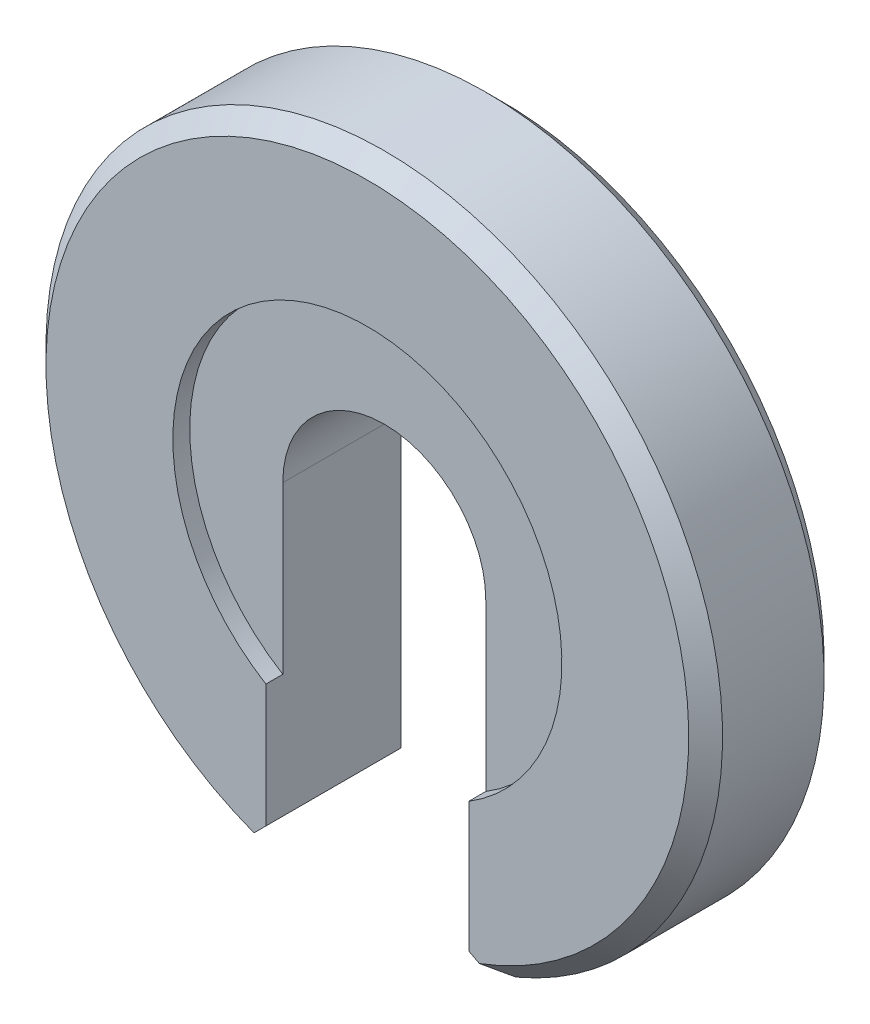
ISO-10303-21;
HEADER;
FILE_DESCRIPTION(('STEP AP214'),'2;1');
FILE_NAME('part.step','',(''),(''),'','','');
FILE_SCHEMA(('AUTOMOTIVE_DESIGN { 1 0 10303 214 1 1 1 1 }'));
ENDSEC;
DATA;
#1=APPLICATION_CONTEXT('core data for automotive mechanical design processes');
#2=APPLICATION_PROTOCOL_DEFINITION('international standard','automotive_design',2000,#1);
#3=PRODUCT_CONTEXT('',#1,'mechanical');
#4=PRODUCT('Part','Part','',(#3));
#5=PRODUCT_RELATED_PRODUCT_CATEGORY('part','',(#4));
#6=PRODUCT_DEFINITION_FORMATION('','',#4);
#7=PRODUCT_DEFINITION_CONTEXT('part definition',#1,'design');
#8=PRODUCT_DEFINITION('design','',#6,#7);
#9=PRODUCT_DEFINITION_SHAPE('','',#8);
#10=(LENGTH_UNIT() NAMED_UNIT(*) SI_UNIT(.MILLI.,.METRE.));
#11=(NAMED_UNIT(*) PLANE_ANGLE_UNIT() SI_UNIT($,.RADIAN.));
#12=(NAMED_UNIT(*) SI_UNIT($,.STERADIAN.) SOLID_ANGLE_UNIT());
#13=UNCERTAINTY_MEASURE_WITH_UNIT(LENGTH_MEASURE(1.E-05),#10,'distance_accuracy_value','');
#14=(GEOMETRIC_REPRESENTATION_CONTEXT(3) GLOBAL_UNCERTAINTY_ASSIGNED_CONTEXT((#13)) GLOBAL_UNIT_ASSIGNED_CONTEXT((#10,
#11,#12)) REPRESENTATION_CONTEXT('',''));
#15=CARTESIAN_POINT('',(0.,0.,0.));
#16=DIRECTION('',(0.,0.,1.));
#17=DIRECTION('',(1.,0.,0.));
#18=AXIS2_PLACEMENT_3D('',#15,#16,#17);
#19=CARTESIAN_POINT('',(0.,0.,-8.));
#20=DIRECTION('',(0.,0.,1.));
#21=DIRECTION('',(1.,0.,0.));
#22=AXIS2_PLACEMENT_3D('',#19,#20,#21);
#23=CYLINDRICAL_SURFACE('',#22,6.);
#24=CARTESIAN_POINT('',(0.,0.,-1.00000000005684));
#25=DIRECTION('',(0.,0.,1.));
#26=DIRECTION('',(1.,0.,0.));
#27=AXIS2_PLACEMENT_3D('',#24,#25,#26);
#28=CIRCLE('',#27,6.);
#29=CARTESIAN_POINT('',(-6.,0.,-1.00000000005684));
#30=VERTEX_POINT('',#29);
#31=CARTESIAN_POINT('',(6.,0.,-1.00000000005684));
#32=VERTEX_POINT('',#31);
#33=EDGE_CURVE('E55',#30,#32,#28,.F.);
#34=ORIENTED_EDGE('',*,*,#33,.F.);
#35=DIRECTION('',(0.,0.,1.));
#36=VECTOR('',#35,1.);
#37=CARTESIAN_POINT('',(-6.,0.,-8.));
#38=LINE('',#37,#36);
#39=CARTESIAN_POINT('',(-6.,0.,-8.));
#40=VERTEX_POINT('',#39);
#41=EDGE_CURVE('E148',#40,#30,#38,.T.);
#42=ORIENTED_EDGE('',*,*,#41,.F.);
#43=CARTESIAN_POINT('',(0.,0.,-8.));
#44=DIRECTION('',(0.,0.,1.));
#45=DIRECTION('',(-1.,0.,0.));
#46=AXIS2_PLACEMENT_3D('',#43,#44,#45);
#47=CIRCLE('',#46,6.);
#48=CARTESIAN_POINT('',(6.,0.,-8.));
#49=VERTEX_POINT('',#48);
#50=EDGE_CURVE('E143',#49,#40,#47,.T.);
#51=ORIENTED_EDGE('',*,*,#50,.F.);
#52=DIRECTION('',(0.,0.,1.));
#53=VECTOR('',#52,1.);
#54=CARTESIAN_POINT('',(6.,0.,-8.));
#55=LINE('',#54,#53);
#56=EDGE_CURVE('E151',#49,#32,#55,.T.);
#57=ORIENTED_EDGE('',*,*,#56,.T.);
#58=EDGE_LOOP('',(#34,#42,#51,#57));
#59=FACE_BOUND('',#58,.T.);
#60=ADVANCED_FACE('F39',(#59),#23,.F.);
#61=CARTESIAN_POINT('',(0.,0.,-8.));
#62=DIRECTION('',(0.,0.,1.));
#63=DIRECTION('',(1.,0.,0.));
#64=AXIS2_PLACEMENT_3D('',#61,#62,#63);
#65=CYLINDRICAL_SURFACE('',#64,20.);
#66=CARTESIAN_POINT('',(0.,0.,-1.00000000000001));
#67=DIRECTION('',(0.,0.,1.));
#68=DIRECTION('',(1.,0.,0.));
#69=AXIS2_PLACEMENT_3D('',#66,#67,#68);
#70=CIRCLE('',#69,20.);
#71=CARTESIAN_POINT('',(-7.47272296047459,-18.5515069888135,-1.00000000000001));
#72=VERTEX_POINT('',#71);
#73=CARTESIAN_POINT('',(7.79340894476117,-18.4190873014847,-1.00000000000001));
#74=VERTEX_POINT('',#73);
#75=EDGE_CURVE('E159',#72,#74,#70,.F.);
#76=ORIENTED_EDGE('',*,*,#75,.T.);
#77=DIRECTION('',(0.,0.,1.));
#78=VECTOR('',#77,1.);
#79=CARTESIAN_POINT('',(7.79340894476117,-18.4190873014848,-8.));
#80=LINE('',#79,#78);
#81=CARTESIAN_POINT('',(7.79340894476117,-18.4190873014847,-6.99999999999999));
#82=VERTEX_POINT('',#81);
#83=EDGE_CURVE('E214',#74,#82,#80,.F.);
#84=ORIENTED_EDGE('',*,*,#83,.T.);
#85=CARTESIAN_POINT('',(0.,0.,-6.99999999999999));
#86=DIRECTION('',(0.,0.,1.));
#87=DIRECTION('',(1.,0.,0.));
#88=AXIS2_PLACEMENT_3D('',#85,#86,#87);
#89=CIRCLE('',#88,20.);
#90=CARTESIAN_POINT('',(-7.47272296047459,-18.5515069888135,-6.99999999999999));
#91=VERTEX_POINT('',#90);
#92=EDGE_CURVE('E156',#82,#91,#89,.T.);
#93=ORIENTED_EDGE('',*,*,#92,.T.);
#94=DIRECTION('',(0.,0.,1.));
#95=VECTOR('',#94,1.);
#96=CARTESIAN_POINT('',(-7.47272296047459,-18.5515069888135,-8.));
#97=LINE('',#96,#95);
#98=EDGE_CURVE('E215',#91,#72,#97,.T.);
#99=ORIENTED_EDGE('',*,*,#98,.T.);
#100=EDGE_LOOP('',(#76,#84,#93,#99));
#101=FACE_BOUND('',#100,.T.);
#102=ADVANCED_FACE('F191',(#101),#65,.T.);
#103=CARTESIAN_POINT('',(0.,0.,-8.));
#104=DIRECTION('',(0.,0.,1.));
#105=DIRECTION('',(1.,0.,0.));
#106=AXIS2_PLACEMENT_3D('',#103,#104,#105);
#107=PLANE('',#106);
#108=CARTESIAN_POINT('',(0.,0.,-8.));
#109=DIRECTION('',(0.,0.,1.));
#110=DIRECTION('',(1.,0.,0.));
#111=AXIS2_PLACEMENT_3D('',#108,#109,#110);
#112=CIRCLE('',#111,19.);
#113=CARTESIAN_POINT('',(-6.7005073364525,-17.7792913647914,-8.));
#114=VERTEX_POINT('',#113);
#115=CARTESIAN_POINT('',(6.62255143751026,-17.8084758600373,-8.));
#116=VERTEX_POINT('',#115);
#117=EDGE_CURVE('E162',#114,#116,#112,.F.);
#118=ORIENTED_EDGE('',*,*,#117,.T.);
#119=DIRECTION('',(0.886668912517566,-0.462404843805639,0.));
#120=VECTOR('',#119,1.);
#121=CARTESIAN_POINT('',(6.,-17.4838103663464,-8.));
#122=LINE('',#121,#120);
#123=CARTESIAN_POINT('',(6.,-17.4838103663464,-8.));
#124=VERTEX_POINT('',#123);
#125=EDGE_CURVE('E228',#116,#124,#122,.F.);
#126=ORIENTED_EDGE('',*,*,#125,.T.);
#127=DIRECTION('',(0.,1.,0.));
#128=VECTOR('',#127,1.);
#129=CARTESIAN_POINT('',(6.,0.,-8.));
#130=LINE('',#129,#128);
#131=EDGE_CURVE('E141',#124,#49,#130,.T.);
#132=ORIENTED_EDGE('',*,*,#131,.T.);
#133=ORIENTED_EDGE('',*,*,#50,.T.);
#134=DIRECTION('',(0.,-1.,0.));
#135=VECTOR('',#134,1.);
#136=CARTESIAN_POINT('',(-6.,-19.0787840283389,-8.));
#137=LINE('',#136,#135);
#138=CARTESIAN_POINT('',(-6.,-17.0787840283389,-8.));
#139=VERTEX_POINT('',#138);
#140=EDGE_CURVE('E154',#40,#139,#137,.T.);
#141=ORIENTED_EDGE('',*,*,#140,.T.);
#142=DIRECTION('',(0.707106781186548,0.707106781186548,0.));
#143=VECTOR('',#142,1.);
#144=CARTESIAN_POINT('',(-7.47272296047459,-18.5515069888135,-8.));
#145=LINE('',#144,#143);
#146=EDGE_CURVE('E230',#139,#114,#145,.F.);
#147=ORIENTED_EDGE('',*,*,#146,.T.);
#148=EDGE_LOOP('',(#118,#126,#132,#133,#141,#147));
#149=FACE_BOUND('',#148,.T.);
#150=ADVANCED_FACE('F243',(#149),#107,.F.);
#151=CARTESIAN_POINT('',(0.,0.,0.));
#152=DIRECTION('',(0.,0.,1.));
#153=DIRECTION('',(1.,0.,0.));
#154=AXIS2_PLACEMENT_3D('',#151,#152,#153);
#155=PLANE('',#154);
#156=CARTESIAN_POINT('',(0.,0.,-5.6843418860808E-11));
#157=DIRECTION('',(0.,0.,1.));
#158=DIRECTION('',(1.,0.,0.));
#159=AXIS2_PLACEMENT_3D('',#156,#157,#158);
#160=CIRCLE('',#159,11.5);
#161=CARTESIAN_POINT('',(6.,-9.81070843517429,-5.6843418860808E-11));
#162=VERTEX_POINT('',#161);
#163=CARTESIAN_POINT('',(-6.,-9.81070843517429,-5.6843418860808E-11));
#164=VERTEX_POINT('',#163);
#165=EDGE_CURVE('E117',#162,#164,#160,.T.);
#166=ORIENTED_EDGE('',*,*,#165,.F.);
#167=DIRECTION('',(0.,1.,0.));
#168=VECTOR('',#167,1.);
#169=CARTESIAN_POINT('',(6.,0.,0.));
#170=LINE('',#169,#168);
#171=CARTESIAN_POINT('',(6.,-17.4838103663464,0.));
#172=VERTEX_POINT('',#171);
#173=EDGE_CURVE('E135',#172,#162,#170,.T.);
#174=ORIENTED_EDGE('',*,*,#173,.F.);
#175=DIRECTION('',(-0.886668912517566,0.462404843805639,0.));
#176=VECTOR('',#175,1.);
#177=CARTESIAN_POINT('',(-5.88545281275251,-11.2854528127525,0.));
#178=LINE('',#177,#176);
#179=CARTESIAN_POINT('',(6.62255143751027,-17.8084758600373,0.));
#180=VERTEX_POINT('',#179);
#181=EDGE_CURVE('E169',#172,#180,#178,.F.);
#182=ORIENTED_EDGE('',*,*,#181,.T.);
#183=CARTESIAN_POINT('',(0.,0.,0.));
#184=DIRECTION('',(0.,0.,1.));
#185=DIRECTION('',(1.,0.,0.));
#186=AXIS2_PLACEMENT_3D('',#183,#184,#185);
#187=CIRCLE('',#186,19.);
#188=CARTESIAN_POINT('',(-6.7005073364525,-17.7792913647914,0.));
#189=VERTEX_POINT('',#188);
#190=EDGE_CURVE('E150',#180,#189,#187,.T.);
#191=ORIENTED_EDGE('',*,*,#190,.T.);
#192=DIRECTION('',(-0.707106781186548,-0.707106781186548,0.));
#193=VECTOR('',#192,1.);
#194=CARTESIAN_POINT('',(5.53939201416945,-5.53939201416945,0.));
#195=LINE('',#194,#193);
#196=CARTESIAN_POINT('',(-6.,-17.0787840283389,0.));
#197=VERTEX_POINT('',#196);
#198=EDGE_CURVE('E140',#189,#197,#195,.F.);
#199=ORIENTED_EDGE('',*,*,#198,.T.);
#200=DIRECTION('',(0.,-1.,0.));
#201=VECTOR('',#200,1.);
#202=CARTESIAN_POINT('',(-6.,-19.0787840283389,0.));
#203=LINE('',#202,#201);
#204=EDGE_CURVE('E131',#164,#197,#203,.T.);
#205=ORIENTED_EDGE('',*,*,#204,.F.);
#206=EDGE_LOOP('',(#166,#174,#182,#191,#199,#205));
#207=FACE_BOUND('',#206,.T.);
#208=ADVANCED_FACE('F137',(#207),#155,.T.);
#209=CARTESIAN_POINT('',(0.,0.,0.));
#210=DIRECTION('',(0.,0.,-1.));
#211=DIRECTION('',(-1.,0.,0.));
#212=AXIS2_PLACEMENT_3D('',#209,#210,#211);
#213=CONICAL_SURFACE('',#212,19.,0.785398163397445);
#214=ORIENTED_EDGE('',*,*,#190,.F.);
#215=CARTESIAN_POINT('',(6.62255143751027,-17.8084758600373,0.));
#216=CARTESIAN_POINT('',(6.72082188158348,-17.8597246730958,-0.0822880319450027));
#217=CARTESIAN_POINT('',(6.81890789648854,-17.9108773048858,-0.164855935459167));
#218=CARTESIAN_POINT('',(7.01472407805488,-18.0129969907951,-0.330521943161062));
#219=CARTESIAN_POINT('',(7.11245425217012,-18.0639640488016,-0.413620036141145));
#220=CARTESIAN_POINT('',(7.30757574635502,-18.1657214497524,-0.580320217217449));
#221=CARTESIAN_POINT('',(7.40496706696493,-18.2165117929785,-0.66392230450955));
#222=CARTESIAN_POINT('',(7.59942703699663,-18.3179242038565,-0.831607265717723));
#223=CARTESIAN_POINT('',(7.69649567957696,-18.3685462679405,-0.915690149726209));
#224=CARTESIAN_POINT('',(7.79340894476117,-18.4190873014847,-1.00000000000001));
#225=B_SPLINE_CURVE_WITH_KNOTS('',3,(#215,#216,#217,#218,#219,#220,#221,#222,#223,#224),
.UNSPECIFIED.,.F.,.F.,(4,2,2,2,4),(0.,0.414117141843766,0.828225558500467,1.24233331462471,
1.65644979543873),.UNSPECIFIED.);
#226=EDGE_CURVE('E178',#180,#74,#225,.T.);
#227=ORIENTED_EDGE('',*,*,#226,.T.);
#228=ORIENTED_EDGE('',*,*,#75,.F.);
#229=CARTESIAN_POINT('',(-7.47272296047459,-18.5515069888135,-1.00000000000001));
#230=CARTESIAN_POINT('',(-7.34431028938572,-18.4230943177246,-0.832885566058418));
#231=CARTESIAN_POINT('',(-7.2157526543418,-18.2945366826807,-0.665995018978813));
#232=CARTESIAN_POINT('',(-6.95834744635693,-18.0371314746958,-0.332661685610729));
#233=CARTESIAN_POINT('',(-6.82949987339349,-17.9082839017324,-0.166218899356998));
#234=CARTESIAN_POINT('',(-6.7005073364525,-17.7792913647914,0.));
#235=B_SPLINE_CURVE_WITH_KNOTS('',3,(#229,#230,#231,#232,#233,#234),.UNSPECIFIED.,.F.,.F.,(4,2,
4),(0.,0.740377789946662,1.48075563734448),.UNSPECIFIED.);
#236=EDGE_CURVE('E171',#72,#189,#235,.T.);
#237=ORIENTED_EDGE('',*,*,#236,.T.);
#238=EDGE_LOOP('',(#214,#227,#228,#237));
#239=FACE_BOUND('',#238,.T.);
#240=ADVANCED_FACE('F184',(#239),#213,.T.);
#241=CARTESIAN_POINT('',(0.,0.,-6.99999999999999));
#242=DIRECTION('',(0.,0.,1.));
#243=DIRECTION('',(1.,0.,0.));
#244=AXIS2_PLACEMENT_3D('',#241,#242,#243);
#245=CONICAL_SURFACE('',#244,20.,0.78539816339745);
#246=ORIENTED_EDGE('',*,*,#92,.F.);
#247=CARTESIAN_POINT('',(7.79340894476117,-18.4190873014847,-6.99999999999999));
#248=CARTESIAN_POINT('',(7.69649567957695,-18.3685462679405,-7.08430985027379));
#249=CARTESIAN_POINT('',(7.59942703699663,-18.3179242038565,-7.16839273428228));
#250=CARTESIAN_POINT('',(7.40496706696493,-18.2165117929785,-7.33607769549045));
#251=CARTESIAN_POINT('',(7.30757574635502,-18.1657214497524,-7.41967978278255));
#252=CARTESIAN_POINT('',(7.11245425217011,-18.0639640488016,-7.58637996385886));
#253=CARTESIAN_POINT('',(7.01472407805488,-18.0129969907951,-7.66947805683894));
#254=CARTESIAN_POINT('',(6.81890789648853,-17.9108773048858,-7.83514406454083));
#255=CARTESIAN_POINT('',(6.72082188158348,-17.8597246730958,-7.917711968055));
#256=CARTESIAN_POINT('',(6.62255143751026,-17.8084758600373,-8.));
#257=B_SPLINE_CURVE_WITH_KNOTS('',3,(#247,#248,#249,#250,#251,#252,#253,#254,#255,#256),
.UNSPECIFIED.,.F.,.F.,(4,2,2,2,4),(0.,0.414116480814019,0.828224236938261,1.24233265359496,
1.65644979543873),.UNSPECIFIED.);
#258=EDGE_CURVE('E201',#82,#116,#257,.T.);
#259=ORIENTED_EDGE('',*,*,#258,.T.);
#260=ORIENTED_EDGE('',*,*,#117,.F.);
#261=CARTESIAN_POINT('',(-6.7005073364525,-17.7792913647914,-8.));
#262=CARTESIAN_POINT('',(-6.82949987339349,-17.9082839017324,-7.833781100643));
#263=CARTESIAN_POINT('',(-6.95834744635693,-18.0371314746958,-7.66733831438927));
#264=CARTESIAN_POINT('',(-7.2157526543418,-18.2945366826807,-7.33400498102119));
#265=CARTESIAN_POINT('',(-7.34431028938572,-18.4230943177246,-7.16711443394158));
#266=CARTESIAN_POINT('',(-7.47272296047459,-18.5515069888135,-6.99999999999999));
#267=B_SPLINE_CURVE_WITH_KNOTS('',3,(#261,#262,#263,#264,#265,#266),.UNSPECIFIED.,.F.,.F.,(4,2,
4),(0.,0.740377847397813,1.48075563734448),.UNSPECIFIED.);
#268=EDGE_CURVE('E208',#114,#91,#267,.T.);
#269=ORIENTED_EDGE('',*,*,#268,.T.);
#270=EDGE_LOOP('',(#246,#259,#260,#269));
#271=FACE_BOUND('',#270,.T.);
#272=ADVANCED_FACE('F189',(#271),#245,.T.);
#273=CARTESIAN_POINT('',(-6.,-19.0787840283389,-8.));
#274=DIRECTION('',(-1.,0.,0.));
#275=DIRECTION('',(0.,0.,1.));
#276=AXIS2_PLACEMENT_3D('',#273,#274,#275);
#277=PLANE('',#276);
#278=DIRECTION('',(0.,1.,0.));
#279=VECTOR('',#278,1.);
#280=CARTESIAN_POINT('',(-6.,-19.0787840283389,-1.00000000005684));
#281=LINE('',#280,#279);
#282=CARTESIAN_POINT('',(-6.,-9.81070843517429,-1.00000000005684));
#283=VERTEX_POINT('',#282);
#284=EDGE_CURVE('E134',#283,#30,#281,.T.);
#285=ORIENTED_EDGE('',*,*,#284,.F.);
#286=DIRECTION('',(0.,0.,1.));
#287=VECTOR('',#286,1.);
#288=CARTESIAN_POINT('',(-6.,-9.81070843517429,-1.00000000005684));
#289=LINE('',#288,#287);
#290=EDGE_CURVE('E121',#283,#164,#289,.T.);
#291=ORIENTED_EDGE('',*,*,#290,.T.);
#292=ORIENTED_EDGE('',*,*,#204,.T.);
#293=DIRECTION('',(0.,0.,-1.));
#294=VECTOR('',#293,1.);
#295=CARTESIAN_POINT('',(-6.,-17.0787840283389,-6.99999999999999));
#296=LINE('',#295,#294);
#297=EDGE_CURVE('E63',#197,#139,#296,.T.);
#298=ORIENTED_EDGE('',*,*,#297,.T.);
#299=ORIENTED_EDGE('',*,*,#140,.F.);
#300=ORIENTED_EDGE('',*,*,#41,.T.);
#301=EDGE_LOOP('',(#285,#291,#292,#298,#299,#300));
#302=FACE_BOUND('',#301,.T.);
#303=ADVANCED_FACE('F130',(#302),#277,.F.);
#304=CARTESIAN_POINT('',(6.,0.,-8.));
#305=DIRECTION('',(1.,0.,0.));
#306=DIRECTION('',(0.,1.,0.));
#307=AXIS2_PLACEMENT_3D('',#304,#305,#306);
#308=PLANE('',#307);
#309=ORIENTED_EDGE('',*,*,#173,.T.);
#310=DIRECTION('',(0.,0.,1.));
#311=VECTOR('',#310,1.);
#312=CARTESIAN_POINT('',(6.,-9.81070843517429,-1.00000000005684));
#313=LINE('',#312,#311);
#314=CARTESIAN_POINT('',(6.,-9.81070843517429,-1.00000000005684));
#315=VERTEX_POINT('',#314);
#316=EDGE_CURVE('E11',#162,#315,#313,.F.);
#317=ORIENTED_EDGE('',*,*,#316,.T.);
#318=DIRECTION('',(0.,-1.,0.));
#319=VECTOR('',#318,1.);
#320=CARTESIAN_POINT('',(6.,0.,-1.00000000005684));
#321=LINE('',#320,#319);
#322=EDGE_CURVE('E48',#32,#315,#321,.T.);
#323=ORIENTED_EDGE('',*,*,#322,.F.);
#324=ORIENTED_EDGE('',*,*,#56,.F.);
#325=ORIENTED_EDGE('',*,*,#131,.F.);
#326=DIRECTION('',(0.,0.,1.));
#327=VECTOR('',#326,1.);
#328=CARTESIAN_POINT('',(6.,-17.4838103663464,-1.00000000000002));
#329=LINE('',#328,#327);
#330=EDGE_CURVE('E165',#124,#172,#329,.T.);
#331=ORIENTED_EDGE('',*,*,#330,.T.);
#332=EDGE_LOOP('',(#309,#317,#323,#324,#325,#331));
#333=FACE_BOUND('',#332,.T.);
#334=ADVANCED_FACE('F239',(#333),#308,.F.);
#335=CARTESIAN_POINT('',(6.,-17.4838103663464,-8.));
#336=DIRECTION('',(0.462404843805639,0.886668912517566,0.));
#337=DIRECTION('',(-0.886668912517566,0.462404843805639,0.));
#338=AXIS2_PLACEMENT_3D('',#335,#336,#337);
#339=PLANE('',#338);
#340=ORIENTED_EDGE('',*,*,#258,.F.);
#341=ORIENTED_EDGE('',*,*,#83,.F.);
#342=ORIENTED_EDGE('',*,*,#226,.F.);
#343=ORIENTED_EDGE('',*,*,#181,.F.);
#344=ORIENTED_EDGE('',*,*,#330,.F.);
#345=ORIENTED_EDGE('',*,*,#125,.F.);
#346=EDGE_LOOP('',(#340,#341,#342,#343,#344,#345));
#347=FACE_BOUND('',#346,.T.);
#348=ADVANCED_FACE('F197',(#347),#339,.F.);
#349=CARTESIAN_POINT('',(-7.47272296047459,-18.5515069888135,-8.));
#350=DIRECTION('',(-0.707106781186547,0.707106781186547,0.));
#351=DIRECTION('',(-0.707106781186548,-0.707106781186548,0.));
#352=AXIS2_PLACEMENT_3D('',#349,#350,#351);
#353=PLANE('',#352);
#354=ORIENTED_EDGE('',*,*,#146,.F.);
#355=ORIENTED_EDGE('',*,*,#297,.F.);
#356=ORIENTED_EDGE('',*,*,#198,.F.);
#357=ORIENTED_EDGE('',*,*,#236,.F.);
#358=ORIENTED_EDGE('',*,*,#98,.F.);
#359=ORIENTED_EDGE('',*,*,#268,.F.);
#360=EDGE_LOOP('',(#354,#355,#356,#357,#358,#359));
#361=FACE_BOUND('',#360,.T.);
#362=ADVANCED_FACE('F41',(#361),#353,.F.);
#363=CARTESIAN_POINT('',(0.,0.,-1.00000000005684));
#364=DIRECTION('',(0.,0.,1.));
#365=DIRECTION('',(1.,0.,0.));
#366=AXIS2_PLACEMENT_3D('',#363,#364,#365);
#367=CYLINDRICAL_SURFACE('',#366,11.5);
#368=CARTESIAN_POINT('',(0.,0.,-1.00000000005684));
#369=DIRECTION('',(0.,0.,1.));
#370=DIRECTION('',(1.,0.,0.));
#371=AXIS2_PLACEMENT_3D('',#368,#369,#370);
#372=CIRCLE('',#371,11.5);
#373=EDGE_CURVE('E127',#315,#283,#372,.T.);
#374=ORIENTED_EDGE('',*,*,#373,.F.);
#375=ORIENTED_EDGE('',*,*,#316,.F.);
#376=ORIENTED_EDGE('',*,*,#165,.T.);
#377=ORIENTED_EDGE('',*,*,#290,.F.);
#378=EDGE_LOOP('',(#374,#375,#376,#377));
#379=FACE_BOUND('',#378,.T.);
#380=ADVANCED_FACE('F120',(#379),#367,.F.);
#381=CARTESIAN_POINT('',(0.,0.,-1.00000000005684));
#382=DIRECTION('',(0.,0.,1.));
#383=DIRECTION('',(1.,0.,0.));
#384=AXIS2_PLACEMENT_3D('',#381,#382,#383);
#385=PLANE('',#384);
#386=ORIENTED_EDGE('',*,*,#284,.T.);
#387=ORIENTED_EDGE('',*,*,#33,.T.);
#388=ORIENTED_EDGE('',*,*,#322,.T.);
#389=ORIENTED_EDGE('',*,*,#373,.T.);
#390=EDGE_LOOP('',(#386,#387,#388,#389));
#391=FACE_BOUND('',#390,.T.);
#392=ADVANCED_FACE('F235',(#391),#385,.T.);
#393=CLOSED_SHELL('',(#60,#102,#150,#208,#240,#272,#303,#334,#348,#362,#380,#392));
#394=MANIFOLD_SOLID_BREP('B2',#393);
#395=ADVANCED_BREP_SHAPE_REPRESENTATION('',(#18,#394),#14);
#396=SHAPE_DEFINITION_REPRESENTATION(#9,#395);
ENDSEC;
END-ISO-10303-21;
